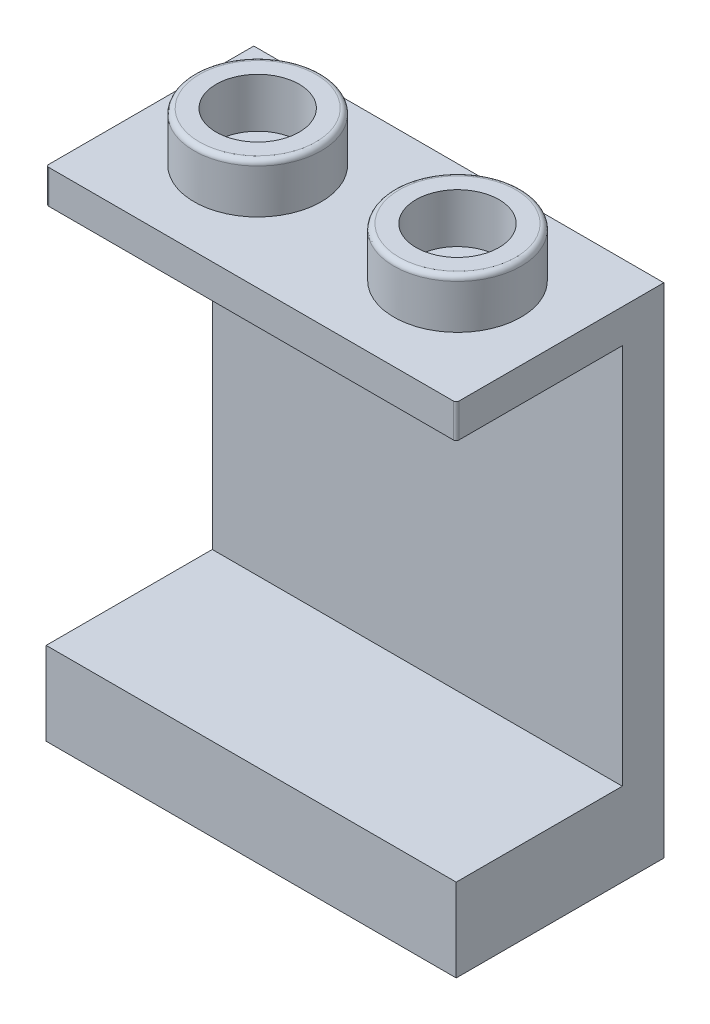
ISO-10303-21;
HEADER;
FILE_DESCRIPTION(('STEP AP214'),'2;1');
FILE_NAME('part.step','',(''),(''),'','','');
FILE_SCHEMA(('AUTOMOTIVE_DESIGN { 1 0 10303 214 1 1 1 1 }'));
ENDSEC;
DATA;
#1=APPLICATION_CONTEXT('core data for automotive mechanical design processes');
#2=APPLICATION_PROTOCOL_DEFINITION('international standard','automotive_design',2000,#1);
#3=PRODUCT_CONTEXT('',#1,'mechanical');
#4=PRODUCT('Part','Part','',(#3));
#5=PRODUCT_RELATED_PRODUCT_CATEGORY('part','',(#4));
#6=PRODUCT_DEFINITION_FORMATION('','',#4);
#7=PRODUCT_DEFINITION_CONTEXT('part definition',#1,'design');
#8=PRODUCT_DEFINITION('design','',#6,#7);
#9=PRODUCT_DEFINITION_SHAPE('','',#8);
#10=(LENGTH_UNIT() NAMED_UNIT(*) SI_UNIT(.MILLI.,.METRE.));
#11=(NAMED_UNIT(*) PLANE_ANGLE_UNIT() SI_UNIT($,.RADIAN.));
#12=(NAMED_UNIT(*) SI_UNIT($,.STERADIAN.) SOLID_ANGLE_UNIT());
#13=UNCERTAINTY_MEASURE_WITH_UNIT(LENGTH_MEASURE(1.E-05),#10,'distance_accuracy_value','');
#14=(GEOMETRIC_REPRESENTATION_CONTEXT(3) GLOBAL_UNCERTAINTY_ASSIGNED_CONTEXT((#13)) GLOBAL_UNIT_ASSIGNED_CONTEXT((#10,
#11,#12)) REPRESENTATION_CONTEXT('',''));
#15=CARTESIAN_POINT('',(0.,0.,0.));
#16=DIRECTION('',(0.,0.,1.));
#17=DIRECTION('',(1.,0.,0.));
#18=AXIS2_PLACEMENT_3D('',#15,#16,#17);
#19=CARTESIAN_POINT('',(14.2,2.1,6.4));
#20=DIRECTION('',(0.,1.,0.));
#21=DIRECTION('',(0.,0.,1.));
#22=AXIS2_PLACEMENT_3D('',#19,#20,#21);
#23=PLANE('',#22);
#24=DIRECTION('',(0.,0.,1.));
#25=VECTOR('',#24,1.);
#26=CARTESIAN_POINT('',(14.2,2.1,6.4));
#27=LINE('',#26,#25);
#28=CARTESIAN_POINT('',(14.2,2.1,1.6));
#29=VERTEX_POINT('',#28);
#30=CARTESIAN_POINT('',(14.2,2.1,6.4));
#31=VERTEX_POINT('',#30);
#32=EDGE_CURVE('E154',#29,#31,#27,.T.);
#33=ORIENTED_EDGE('',*,*,#32,.T.);
#34=DIRECTION('',(-1.,0.,0.));
#35=VECTOR('',#34,1.);
#36=CARTESIAN_POINT('',(14.2,2.1,6.4));
#37=LINE('',#36,#35);
#38=CARTESIAN_POINT('',(1.6,2.1,6.4));
#39=VERTEX_POINT('',#38);
#40=EDGE_CURVE('E160',#31,#39,#37,.T.);
#41=ORIENTED_EDGE('',*,*,#40,.T.);
#42=DIRECTION('',(0.,0.,-1.));
#43=VECTOR('',#42,1.);
#44=CARTESIAN_POINT('',(1.6,2.1,6.4));
#45=LINE('',#44,#43);
#46=CARTESIAN_POINT('',(1.6,2.1,1.6));
#47=VERTEX_POINT('',#46);
#48=EDGE_CURVE('E134',#39,#47,#45,.T.);
#49=ORIENTED_EDGE('',*,*,#48,.T.);
#50=DIRECTION('',(1.,0.,0.));
#51=VECTOR('',#50,1.);
#52=CARTESIAN_POINT('',(14.2,2.1,1.6));
#53=LINE('',#52,#51);
#54=EDGE_CURVE('E163',#47,#29,#53,.T.);
#55=ORIENTED_EDGE('',*,*,#54,.T.);
#56=EDGE_LOOP('',(#33,#41,#49,#55));
#57=FACE_BOUND('',#56,.T.);
#58=CARTESIAN_POINT('',(7.8,2.1,4.));
#59=DIRECTION('',(0.,1.,0.));
#60=DIRECTION('',(0.,0.,1.));
#61=AXIS2_PLACEMENT_3D('',#58,#59,#60);
#62=CIRCLE('',#61,1.55);
#63=CARTESIAN_POINT('',(7.8,2.1,5.55));
#64=VERTEX_POINT('',#63);
#65=EDGE_CURVE('E272',#64,#64,#62,.F.);
#66=ORIENTED_EDGE('',*,*,#65,.F.);
#67=EDGE_LOOP('',(#66));
#68=FACE_BOUND('',#67,.T.);
#69=ADVANCED_FACE('F26',(#57,#68),#23,.F.);
#70=CARTESIAN_POINT('',(0.,19.2,8.));
#71=DIRECTION('',(0.,-1.,0.));
#72=DIRECTION('',(0.,0.,-1.));
#73=AXIS2_PLACEMENT_3D('',#70,#71,#72);
#74=PLANE('',#73);
#75=DIRECTION('',(0.,0.,-1.));
#76=VECTOR('',#75,1.);
#77=CARTESIAN_POINT('',(0.,19.2,8.));
#78=LINE('',#77,#76);
#79=CARTESIAN_POINT('',(0.,19.2,7.9));
#80=VERTEX_POINT('',#79);
#81=CARTESIAN_POINT('',(0.,19.2,0.));
#82=VERTEX_POINT('',#81);
#83=EDGE_CURVE('E228',#80,#82,#78,.T.);
#84=ORIENTED_EDGE('',*,*,#83,.F.);
#85=CARTESIAN_POINT('',(0.0999999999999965,19.2,7.9));
#86=DIRECTION('',(0.,-1.,0.));
#87=DIRECTION('',(0.,0.,-1.));
#88=AXIS2_PLACEMENT_3D('',#85,#86,#87);
#89=CIRCLE('',#88,0.1);
#90=CARTESIAN_POINT('',(0.0999999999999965,19.2,8.));
#91=VERTEX_POINT('',#90);
#92=EDGE_CURVE('E270',#80,#91,#89,.F.);
#93=ORIENTED_EDGE('',*,*,#92,.T.);
#94=DIRECTION('',(-1.,0.,0.));
#95=VECTOR('',#94,1.);
#96=CARTESIAN_POINT('',(0.,19.2,8.));
#97=LINE('',#96,#95);
#98=CARTESIAN_POINT('',(15.7,19.2,8.));
#99=VERTEX_POINT('',#98);
#100=EDGE_CURVE('E225',#99,#91,#97,.T.);
#101=ORIENTED_EDGE('',*,*,#100,.F.);
#102=CARTESIAN_POINT('',(15.7,19.2,7.9));
#103=DIRECTION('',(0.,-1.,0.));
#104=DIRECTION('',(0.,0.,-1.));
#105=AXIS2_PLACEMENT_3D('',#102,#103,#104);
#106=CIRCLE('',#105,0.1);
#107=CARTESIAN_POINT('',(15.8,19.2,7.9));
#108=VERTEX_POINT('',#107);
#109=EDGE_CURVE('E259',#99,#108,#106,.F.);
#110=ORIENTED_EDGE('',*,*,#109,.T.);
#111=DIRECTION('',(0.,0.,-1.));
#112=VECTOR('',#111,1.);
#113=CARTESIAN_POINT('',(15.8,19.2,8.));
#114=LINE('',#113,#112);
#115=CARTESIAN_POINT('',(15.8,19.2,0.));
#116=VERTEX_POINT('',#115);
#117=EDGE_CURVE('E230',#108,#116,#114,.T.);
#118=ORIENTED_EDGE('',*,*,#117,.T.);
#119=DIRECTION('',(-1.,0.,0.));
#120=VECTOR('',#119,1.);
#121=CARTESIAN_POINT('',(0.,19.2,0.));
#122=LINE('',#121,#120);
#123=EDGE_CURVE('E215',#116,#82,#122,.T.);
#124=ORIENTED_EDGE('',*,*,#123,.T.);
#125=EDGE_LOOP('',(#84,#93,#101,#110,#118,#124));
#126=FACE_BOUND('',#125,.T.);
#127=CARTESIAN_POINT('',(4.05,19.2,3.9));
#128=DIRECTION('',(0.,-1.,0.));
#129=DIRECTION('',(0.,0.,-1.));
#130=AXIS2_PLACEMENT_3D('',#127,#128,#129);
#131=CIRCLE('',#130,2.45);
#132=CARTESIAN_POINT('',(4.05,19.2,1.45));
#133=VERTEX_POINT('',#132);
#134=EDGE_CURVE('E238',#133,#133,#131,.F.);
#135=ORIENTED_EDGE('',*,*,#134,.F.);
#136=EDGE_LOOP('',(#135));
#137=FACE_BOUND('',#136,.T.);
#138=CARTESIAN_POINT('',(11.75,19.2,3.9));
#139=DIRECTION('',(0.,-1.,0.));
#140=DIRECTION('',(0.,0.,-1.));
#141=AXIS2_PLACEMENT_3D('',#138,#139,#140);
#142=CIRCLE('',#141,2.45);
#143=CARTESIAN_POINT('',(11.75,19.2,1.45));
#144=VERTEX_POINT('',#143);
#145=EDGE_CURVE('E241',#144,#144,#142,.F.);
#146=ORIENTED_EDGE('',*,*,#145,.F.);
#147=EDGE_LOOP('',(#146));
#148=FACE_BOUND('',#147,.T.);
#149=ADVANCED_FACE('F294',(#126,#137,#148),#74,.F.);
#150=CARTESIAN_POINT('',(0.,19.2,8.));
#151=DIRECTION('',(0.,0.,-1.));
#152=DIRECTION('',(-1.,0.,0.));
#153=AXIS2_PLACEMENT_3D('',#150,#151,#152);
#154=PLANE('',#153);
#155=ORIENTED_EDGE('',*,*,#100,.T.);
#156=DIRECTION('',(0.,-1.,0.));
#157=VECTOR('',#156,1.);
#158=CARTESIAN_POINT('',(0.0999999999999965,19.2,8.));
#159=LINE('',#158,#157);
#160=CARTESIAN_POINT('',(0.0999999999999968,17.9,8.));
#161=VERTEX_POINT('',#160);
#162=EDGE_CURVE('E265',#91,#161,#159,.T.);
#163=ORIENTED_EDGE('',*,*,#162,.T.);
#164=DIRECTION('',(-1.,0.,0.));
#165=VECTOR('',#164,1.);
#166=CARTESIAN_POINT('',(0.,17.9,8.));
#167=LINE('',#166,#165);
#168=CARTESIAN_POINT('',(15.7,17.9,8.));
#169=VERTEX_POINT('',#168);
#170=EDGE_CURVE('E184',#169,#161,#167,.T.);
#171=ORIENTED_EDGE('',*,*,#170,.F.);
#172=DIRECTION('',(0.,1.,0.));
#173=VECTOR('',#172,1.);
#174=CARTESIAN_POINT('',(15.7,19.2,8.));
#175=LINE('',#174,#173);
#176=EDGE_CURVE('E256',#169,#99,#175,.T.);
#177=ORIENTED_EDGE('',*,*,#176,.T.);
#178=EDGE_LOOP('',(#155,#163,#171,#177));
#179=FACE_BOUND('',#178,.T.);
#180=ADVANCED_FACE('F301',(#179),#154,.F.);
#181=CARTESIAN_POINT('',(0.,0.,8.));
#182=DIRECTION('',(1.,0.,0.));
#183=DIRECTION('',(0.,1.,0.));
#184=AXIS2_PLACEMENT_3D('',#181,#182,#183);
#185=PLANE('',#184);
#186=DIRECTION('',(0.,0.,1.));
#187=VECTOR('',#186,1.);
#188=CARTESIAN_POINT('',(0.,17.9,1.6));
#189=LINE('',#188,#187);
#190=CARTESIAN_POINT('',(0.,17.9,1.6));
#191=VERTEX_POINT('',#190);
#192=CARTESIAN_POINT('',(0.,17.9,7.9));
#193=VERTEX_POINT('',#192);
#194=EDGE_CURVE('E198',#191,#193,#189,.T.);
#195=ORIENTED_EDGE('',*,*,#194,.T.);
#196=DIRECTION('',(0.,-1.,0.));
#197=VECTOR('',#196,1.);
#198=CARTESIAN_POINT('',(0.,0.,7.9));
#199=LINE('',#198,#197);
#200=EDGE_CURVE('E41',#193,#80,#199,.F.);
#201=ORIENTED_EDGE('',*,*,#200,.T.);
#202=ORIENTED_EDGE('',*,*,#83,.T.);
#203=DIRECTION('',(0.,-1.,0.));
#204=VECTOR('',#203,1.);
#205=CARTESIAN_POINT('',(0.,0.,0.));
#206=LINE('',#205,#204);
#207=CARTESIAN_POINT('',(0.,0.,0.));
#208=VERTEX_POINT('',#207);
#209=EDGE_CURVE('E200',#82,#208,#206,.T.);
#210=ORIENTED_EDGE('',*,*,#209,.T.);
#211=DIRECTION('',(0.,0.,-1.));
#212=VECTOR('',#211,1.);
#213=CARTESIAN_POINT('',(0.,0.,8.));
#214=LINE('',#213,#212);
#215=CARTESIAN_POINT('',(0.,0.,8.));
#216=VERTEX_POINT('',#215);
#217=EDGE_CURVE('E235',#216,#208,#214,.T.);
#218=ORIENTED_EDGE('',*,*,#217,.F.);
#219=DIRECTION('',(0.,-1.,0.));
#220=VECTOR('',#219,1.);
#221=CARTESIAN_POINT('',(0.,0.,8.));
#222=LINE('',#221,#220);
#223=CARTESIAN_POINT('',(0.,3.2,8.));
#224=VERTEX_POINT('',#223);
#225=EDGE_CURVE('E218',#224,#216,#222,.T.);
#226=ORIENTED_EDGE('',*,*,#225,.F.);
#227=DIRECTION('',(0.,0.,1.));
#228=VECTOR('',#227,1.);
#229=CARTESIAN_POINT('',(0.,3.2,1.6));
#230=LINE('',#229,#228);
#231=CARTESIAN_POINT('',(0.,3.2,1.6));
#232=VERTEX_POINT('',#231);
#233=EDGE_CURVE('E197',#232,#224,#230,.T.);
#234=ORIENTED_EDGE('',*,*,#233,.F.);
#235=DIRECTION('',(0.,-1.,0.));
#236=VECTOR('',#235,1.);
#237=CARTESIAN_POINT('',(0.,17.9,1.6));
#238=LINE('',#237,#236);
#239=EDGE_CURVE('E186',#191,#232,#238,.T.);
#240=ORIENTED_EDGE('',*,*,#239,.F.);
#241=EDGE_LOOP('',(#195,#201,#202,#210,#218,#226,#234,#240));
#242=FACE_BOUND('',#241,.T.);
#243=ADVANCED_FACE('F28',(#242),#185,.F.);
#244=CARTESIAN_POINT('',(0.,0.,8.));
#245=DIRECTION('',(0.,1.,0.));
#246=DIRECTION('',(0.,0.,1.));
#247=AXIS2_PLACEMENT_3D('',#244,#245,#246);
#248=PLANE('',#247);
#249=DIRECTION('',(-1.,0.,0.));
#250=VECTOR('',#249,1.);
#251=CARTESIAN_POINT('',(14.2,0.,6.4));
#252=LINE('',#251,#250);
#253=CARTESIAN_POINT('',(14.2,0.,6.4));
#254=VERTEX_POINT('',#253);
#255=CARTESIAN_POINT('',(1.6,0.,6.4));
#256=VERTEX_POINT('',#255);
#257=EDGE_CURVE('E143',#254,#256,#252,.T.);
#258=ORIENTED_EDGE('',*,*,#257,.F.);
#259=DIRECTION('',(0.,0.,1.));
#260=VECTOR('',#259,1.);
#261=CARTESIAN_POINT('',(14.2,0.,6.4));
#262=LINE('',#261,#260);
#263=CARTESIAN_POINT('',(14.2,0.,1.6));
#264=VERTEX_POINT('',#263);
#265=EDGE_CURVE('E147',#264,#254,#262,.T.);
#266=ORIENTED_EDGE('',*,*,#265,.F.);
#267=DIRECTION('',(1.,0.,0.));
#268=VECTOR('',#267,1.);
#269=CARTESIAN_POINT('',(14.2,0.,1.6));
#270=LINE('',#269,#268);
#271=CARTESIAN_POINT('',(1.6,0.,1.6));
#272=VERTEX_POINT('',#271);
#273=EDGE_CURVE('E152',#272,#264,#270,.T.);
#274=ORIENTED_EDGE('',*,*,#273,.F.);
#275=DIRECTION('',(0.,0.,-1.));
#276=VECTOR('',#275,1.);
#277=CARTESIAN_POINT('',(1.6,0.,6.4));
#278=LINE('',#277,#276);
#279=EDGE_CURVE('E131',#256,#272,#278,.T.);
#280=ORIENTED_EDGE('',*,*,#279,.F.);
#281=EDGE_LOOP('',(#258,#266,#274,#280));
#282=FACE_BOUND('',#281,.T.);
#283=DIRECTION('',(1.,0.,0.));
#284=VECTOR('',#283,1.);
#285=CARTESIAN_POINT('',(0.,0.,0.));
#286=LINE('',#285,#284);
#287=CARTESIAN_POINT('',(15.8,0.,0.));
#288=VERTEX_POINT('',#287);
#289=EDGE_CURVE('E210',#208,#288,#286,.T.);
#290=ORIENTED_EDGE('',*,*,#289,.T.);
#291=DIRECTION('',(0.,0.,-1.));
#292=VECTOR('',#291,1.);
#293=CARTESIAN_POINT('',(15.8,0.,8.));
#294=LINE('',#293,#292);
#295=CARTESIAN_POINT('',(15.8,0.,8.));
#296=VERTEX_POINT('',#295);
#297=EDGE_CURVE('E232',#296,#288,#294,.T.);
#298=ORIENTED_EDGE('',*,*,#297,.F.);
#299=DIRECTION('',(1.,0.,0.));
#300=VECTOR('',#299,1.);
#301=CARTESIAN_POINT('',(0.,0.,8.));
#302=LINE('',#301,#300);
#303=EDGE_CURVE('E220',#216,#296,#302,.T.);
#304=ORIENTED_EDGE('',*,*,#303,.F.);
#305=ORIENTED_EDGE('',*,*,#217,.T.);
#306=EDGE_LOOP('',(#290,#298,#304,#305));
#307=FACE_BOUND('',#306,.T.);
#308=ADVANCED_FACE('F149',(#282,#307),#248,.F.);
#309=CARTESIAN_POINT('',(15.8,0.,8.));
#310=DIRECTION('',(-1.,0.,0.));
#311=DIRECTION('',(0.,-1.,0.));
#312=AXIS2_PLACEMENT_3D('',#309,#310,#311);
#313=PLANE('',#312);
#314=ORIENTED_EDGE('',*,*,#117,.F.);
#315=DIRECTION('',(0.,1.,0.));
#316=VECTOR('',#315,1.);
#317=CARTESIAN_POINT('',(15.8,0.,7.9));
#318=LINE('',#317,#316);
#319=CARTESIAN_POINT('',(15.8,17.9,7.9));
#320=VERTEX_POINT('',#319);
#321=EDGE_CURVE('E261',#108,#320,#318,.F.);
#322=ORIENTED_EDGE('',*,*,#321,.T.);
#323=DIRECTION('',(0.,0.,1.));
#324=VECTOR('',#323,1.);
#325=CARTESIAN_POINT('',(15.8,17.9,1.6));
#326=LINE('',#325,#324);
#327=CARTESIAN_POINT('',(15.8,17.9,1.6));
#328=VERTEX_POINT('',#327);
#329=EDGE_CURVE('E201',#328,#320,#326,.T.);
#330=ORIENTED_EDGE('',*,*,#329,.F.);
#331=DIRECTION('',(0.,1.,0.));
#332=VECTOR('',#331,1.);
#333=CARTESIAN_POINT('',(15.8,17.9,1.6));
#334=LINE('',#333,#332);
#335=CARTESIAN_POINT('',(15.8,3.2,1.6));
#336=VERTEX_POINT('',#335);
#337=EDGE_CURVE('E192',#336,#328,#334,.T.);
#338=ORIENTED_EDGE('',*,*,#337,.F.);
#339=DIRECTION('',(0.,0.,1.));
#340=VECTOR('',#339,1.);
#341=CARTESIAN_POINT('',(15.8,3.2,1.6));
#342=LINE('',#341,#340);
#343=CARTESIAN_POINT('',(15.8,3.2,8.));
#344=VERTEX_POINT('',#343);
#345=EDGE_CURVE('E204',#336,#344,#342,.T.);
#346=ORIENTED_EDGE('',*,*,#345,.T.);
#347=DIRECTION('',(0.,1.,0.));
#348=VECTOR('',#347,1.);
#349=CARTESIAN_POINT('',(15.8,0.,8.));
#350=LINE('',#349,#348);
#351=EDGE_CURVE('E222',#296,#344,#350,.T.);
#352=ORIENTED_EDGE('',*,*,#351,.F.);
#353=ORIENTED_EDGE('',*,*,#297,.T.);
#354=DIRECTION('',(0.,1.,0.));
#355=VECTOR('',#354,1.);
#356=CARTESIAN_POINT('',(15.8,0.,0.));
#357=LINE('',#356,#355);
#358=EDGE_CURVE('E212',#288,#116,#357,.T.);
#359=ORIENTED_EDGE('',*,*,#358,.T.);
#360=EDGE_LOOP('',(#314,#322,#330,#338,#346,#352,#353,#359));
#361=FACE_BOUND('',#360,.T.);
#362=ADVANCED_FACE('F372',(#361),#313,.F.);
#363=ORIENTED_EDGE('',*,*,#351,.T.);
#364=DIRECTION('',(1.,0.,0.));
#365=VECTOR('',#364,1.);
#366=CARTESIAN_POINT('',(0.,3.2,8.));
#367=LINE('',#366,#365);
#368=EDGE_CURVE('E182',#224,#344,#367,.T.);
#369=ORIENTED_EDGE('',*,*,#368,.F.);
#370=ORIENTED_EDGE('',*,*,#225,.T.);
#371=ORIENTED_EDGE('',*,*,#303,.T.);
#372=EDGE_LOOP('',(#363,#369,#370,#371));
#373=FACE_BOUND('',#372,.T.);
#374=ADVANCED_FACE('F369',(#373),#154,.F.);
#375=CARTESIAN_POINT('',(0.,19.2,0.));
#376=DIRECTION('',(0.,0.,-1.));
#377=DIRECTION('',(-1.,0.,0.));
#378=AXIS2_PLACEMENT_3D('',#375,#376,#377);
#379=PLANE('',#378);
#380=ORIENTED_EDGE('',*,*,#209,.F.);
#381=ORIENTED_EDGE('',*,*,#123,.F.);
#382=ORIENTED_EDGE('',*,*,#358,.F.);
#383=ORIENTED_EDGE('',*,*,#289,.F.);
#384=EDGE_LOOP('',(#380,#381,#382,#383));
#385=FACE_BOUND('',#384,.T.);
#386=ADVANCED_FACE('F363',(#385),#379,.T.);
#387=CARTESIAN_POINT('',(0.,17.9,1.6));
#388=DIRECTION('',(0.,1.,0.));
#389=DIRECTION('',(0.,0.,1.));
#390=AXIS2_PLACEMENT_3D('',#387,#388,#389);
#391=PLANE('',#390);
#392=ORIENTED_EDGE('',*,*,#170,.T.);
#393=CARTESIAN_POINT('',(0.0999999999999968,17.9,7.9));
#394=DIRECTION('',(0.,1.,0.));
#395=DIRECTION('',(0.,0.,1.));
#396=AXIS2_PLACEMENT_3D('',#393,#394,#395);
#397=CIRCLE('',#396,0.1);
#398=EDGE_CURVE('E49',#161,#193,#397,.F.);
#399=ORIENTED_EDGE('',*,*,#398,.T.);
#400=ORIENTED_EDGE('',*,*,#194,.F.);
#401=DIRECTION('',(-1.,0.,0.));
#402=VECTOR('',#401,1.);
#403=CARTESIAN_POINT('',(0.,17.9,1.6));
#404=LINE('',#403,#402);
#405=EDGE_CURVE('E194',#328,#191,#404,.T.);
#406=ORIENTED_EDGE('',*,*,#405,.F.);
#407=ORIENTED_EDGE('',*,*,#329,.T.);
#408=CARTESIAN_POINT('',(15.7,17.9,7.9));
#409=DIRECTION('',(0.,1.,0.));
#410=DIRECTION('',(0.,0.,1.));
#411=AXIS2_PLACEMENT_3D('',#408,#409,#410);
#412=CIRCLE('',#411,0.1);
#413=EDGE_CURVE('E263',#320,#169,#412,.F.);
#414=ORIENTED_EDGE('',*,*,#413,.T.);
#415=EDGE_LOOP('',(#392,#399,#400,#406,#407,#414));
#416=FACE_BOUND('',#415,.T.);
#417=ADVANCED_FACE('F360',(#416),#391,.F.);
#418=CARTESIAN_POINT('',(0.,3.2,1.6));
#419=DIRECTION('',(0.,-1.,0.));
#420=DIRECTION('',(1.,0.,0.));
#421=AXIS2_PLACEMENT_3D('',#418,#419,#420);
#422=PLANE('',#421);
#423=ORIENTED_EDGE('',*,*,#368,.T.);
#424=ORIENTED_EDGE('',*,*,#345,.F.);
#425=DIRECTION('',(1.,0.,0.));
#426=VECTOR('',#425,1.);
#427=CARTESIAN_POINT('',(0.,3.2,1.6));
#428=LINE('',#427,#426);
#429=EDGE_CURVE('E189',#232,#336,#428,.T.);
#430=ORIENTED_EDGE('',*,*,#429,.F.);
#431=ORIENTED_EDGE('',*,*,#233,.T.);
#432=EDGE_LOOP('',(#423,#424,#430,#431));
#433=FACE_BOUND('',#432,.T.);
#434=ADVANCED_FACE('F358',(#433),#422,.F.);
#435=CARTESIAN_POINT('',(0.,3.2,1.6));
#436=DIRECTION('',(0.,0.,1.));
#437=DIRECTION('',(1.,0.,0.));
#438=AXIS2_PLACEMENT_3D('',#435,#436,#437);
#439=PLANE('',#438);
#440=ORIENTED_EDGE('',*,*,#239,.T.);
#441=ORIENTED_EDGE('',*,*,#429,.T.);
#442=ORIENTED_EDGE('',*,*,#337,.T.);
#443=ORIENTED_EDGE('',*,*,#405,.T.);
#444=EDGE_LOOP('',(#440,#441,#442,#443));
#445=FACE_BOUND('',#444,.T.);
#446=ADVANCED_FACE('F351',(#445),#439,.T.);
#447=CARTESIAN_POINT('',(4.05,21.1,3.9));
#448=DIRECTION('',(0.,1.,0.));
#449=DIRECTION('',(0.,0.,1.));
#450=AXIS2_PLACEMENT_3D('',#447,#448,#449);
#451=PLANE('',#450);
#452=CARTESIAN_POINT('',(4.05,21.1,3.9));
#453=DIRECTION('',(0.,1.,0.));
#454=DIRECTION('',(0.,0.,1.));
#455=AXIS2_PLACEMENT_3D('',#452,#453,#454);
#456=CIRCLE('',#455,2.25);
#457=CARTESIAN_POINT('',(4.05,21.1,6.15));
#458=VERTEX_POINT('',#457);
#459=EDGE_CURVE('E250',#458,#458,#456,.T.);
#460=ORIENTED_EDGE('',*,*,#459,.T.);
#461=EDGE_LOOP('',(#460));
#462=FACE_BOUND('',#461,.T.);
#463=CARTESIAN_POINT('',(4.05,21.1,3.9));
#464=DIRECTION('',(0.,1.,0.));
#465=DIRECTION('',(0.,0.,1.));
#466=AXIS2_PLACEMENT_3D('',#463,#464,#465);
#467=CIRCLE('',#466,1.6);
#468=CARTESIAN_POINT('',(4.05,21.1,2.3));
#469=VERTEX_POINT('',#468);
#470=EDGE_CURVE('E179',#469,#469,#467,.T.);
#471=ORIENTED_EDGE('',*,*,#470,.F.);
#472=EDGE_LOOP('',(#471));
#473=FACE_BOUND('',#472,.T.);
#474=ADVANCED_FACE('F348',(#462,#473),#451,.T.);
#475=CARTESIAN_POINT('',(4.05,21.1,3.9));
#476=DIRECTION('',(0.,-1.,0.));
#477=DIRECTION('',(0.,0.,-1.));
#478=AXIS2_PLACEMENT_3D('',#475,#476,#477);
#479=CYLINDRICAL_SURFACE('',#478,2.45);
#480=CARTESIAN_POINT('',(4.05,20.9,3.9));
#481=DIRECTION('',(0.,1.,0.));
#482=DIRECTION('',(0.,0.,1.));
#483=AXIS2_PLACEMENT_3D('',#480,#481,#482);
#484=CIRCLE('',#483,2.45);
#485=CARTESIAN_POINT('',(4.05,20.9,1.45));
#486=VERTEX_POINT('',#485);
#487=EDGE_CURVE('E253',#486,#486,#484,.F.);
#488=CARTESIAN_POINT('',(4.05,20.9,1.45));
#489=CARTESIAN_POINT('',(4.05,20.8822916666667,1.45));
#490=CARTESIAN_POINT('',(4.05,20.8645833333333,1.45));
#491=CARTESIAN_POINT('',(4.05,20.8291666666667,1.45));
#492=CARTESIAN_POINT('',(4.05,20.8114583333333,1.45));
#493=CARTESIAN_POINT('',(4.05,20.7760416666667,1.45));
#494=CARTESIAN_POINT('',(4.05,20.7583333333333,1.45));
#495=CARTESIAN_POINT('',(4.05,20.7229166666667,1.45));
#496=CARTESIAN_POINT('',(4.05,20.7052083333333,1.45));
#497=CARTESIAN_POINT('',(4.05,20.6697916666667,1.45));
#498=CARTESIAN_POINT('',(4.05,20.6520833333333,1.45));
#499=CARTESIAN_POINT('',(4.05,20.6166666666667,1.45));
#500=CARTESIAN_POINT('',(4.05,20.5989583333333,1.45));
#501=CARTESIAN_POINT('',(4.05,20.5635416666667,1.45));
#502=CARTESIAN_POINT('',(4.05,20.5458333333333,1.45));
#503=CARTESIAN_POINT('',(4.05,20.5104166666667,1.45));
#504=CARTESIAN_POINT('',(4.05,20.4927083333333,1.45));
#505=CARTESIAN_POINT('',(4.05,20.4572916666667,1.45));
#506=CARTESIAN_POINT('',(4.05,20.4395833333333,1.45));
#507=CARTESIAN_POINT('',(4.05,20.4041666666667,1.45));
#508=CARTESIAN_POINT('',(4.05,20.3864583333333,1.45));
#509=CARTESIAN_POINT('',(4.05,20.3510416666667,1.45));
#510=CARTESIAN_POINT('',(4.05,20.3333333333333,1.45));
#511=CARTESIAN_POINT('',(4.05,20.2979166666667,1.45));
#512=CARTESIAN_POINT('',(4.05,20.2802083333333,1.45));
#513=CARTESIAN_POINT('',(4.05,20.2447916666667,1.45));
#514=CARTESIAN_POINT('',(4.05,20.2270833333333,1.45));
#515=CARTESIAN_POINT('',(4.05,20.1916666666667,1.45));
#516=CARTESIAN_POINT('',(4.05,20.1739583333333,1.45));
#517=CARTESIAN_POINT('',(4.05,20.1385416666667,1.45));
#518=CARTESIAN_POINT('',(4.05,20.1208333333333,1.45));
#519=CARTESIAN_POINT('',(4.05,20.0854166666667,1.45));
#520=CARTESIAN_POINT('',(4.05,20.0677083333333,1.45));
#521=CARTESIAN_POINT('',(4.05,20.0322916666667,1.45));
#522=CARTESIAN_POINT('',(4.05,20.0145833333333,1.45));
#523=CARTESIAN_POINT('',(4.05,19.9791666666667,1.45));
#524=CARTESIAN_POINT('',(4.05,19.9614583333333,1.45));
#525=CARTESIAN_POINT('',(4.05,19.9260416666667,1.45));
#526=CARTESIAN_POINT('',(4.05,19.9083333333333,1.45));
#527=CARTESIAN_POINT('',(4.05,19.8729166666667,1.45));
#528=CARTESIAN_POINT('',(4.05,19.8552083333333,1.45));
#529=CARTESIAN_POINT('',(4.05,19.8197916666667,1.45));
#530=CARTESIAN_POINT('',(4.05,19.8020833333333,1.45));
#531=CARTESIAN_POINT('',(4.05,19.7666666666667,1.45));
#532=CARTESIAN_POINT('',(4.05,19.7489583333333,1.45));
#533=CARTESIAN_POINT('',(4.05,19.7135416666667,1.45));
#534=CARTESIAN_POINT('',(4.05,19.6958333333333,1.45));
#535=CARTESIAN_POINT('',(4.05,19.6604166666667,1.45));
#536=CARTESIAN_POINT('',(4.05,19.6427083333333,1.45));
#537=CARTESIAN_POINT('',(4.05,19.6072916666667,1.45));
#538=CARTESIAN_POINT('',(4.05,19.5895833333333,1.45));
#539=CARTESIAN_POINT('',(4.05,19.5541666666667,1.45));
#540=CARTESIAN_POINT('',(4.05,19.5364583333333,1.45));
#541=CARTESIAN_POINT('',(4.05,19.5010416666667,1.45));
#542=CARTESIAN_POINT('',(4.05,19.4833333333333,1.45));
#543=CARTESIAN_POINT('',(4.05,19.4479166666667,1.45));
#544=CARTESIAN_POINT('',(4.05,19.4302083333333,1.45));
#545=CARTESIAN_POINT('',(4.05,19.3947916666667,1.45));
#546=CARTESIAN_POINT('',(4.05,19.3770833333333,1.45));
#547=CARTESIAN_POINT('',(4.05,19.3416666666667,1.45));
#548=CARTESIAN_POINT('',(4.05,19.3239583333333,1.45));
#549=CARTESIAN_POINT('',(4.05,19.2885416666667,1.45));
#550=CARTESIAN_POINT('',(4.05,19.2708333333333,1.45));
#551=CARTESIAN_POINT('',(4.05,19.2354166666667,1.45));
#552=CARTESIAN_POINT('',(4.05,19.2177083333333,1.45));
#553=CARTESIAN_POINT('',(4.05,19.2,1.45));
#554=B_SPLINE_CURVE_WITH_KNOTS('',3,(#488,#489,#490,#491,#492,#493,#494,#495,#496,#497,#498,
#499,#500,#501,#502,#503,#504,#505,#506,#507,#508,#509,#510,#511,#512,#513,#514,#515,#516,#517,
#518,#519,#520,#521,#522,#523,#524,#525,#526,#527,#528,#529,#530,#531,#532,#533,#534,#535,#536,
#537,#538,#539,#540,#541,#542,#543,#544,#545,#546,#547,#548,#549,#550,#551,#552,#553),
.UNSPECIFIED.,.F.,.F.,(4,2,2,2,2,2,2,2,2,2,2,2,2,2,2,2,2,2,2,2,2,2,2,2,2,2,2,2,2,2,2,2,4),(0.,
0.0531250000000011,0.106250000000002,0.159375,0.212500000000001,0.265625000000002,0.31875,
0.371875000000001,0.425000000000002,0.478124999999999,0.53125,0.584375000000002,
0.637499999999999,0.690625,0.743750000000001,0.796874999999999,0.85,0.903125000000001,
0.956249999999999,1.009375,1.0625,1.115625,1.16875,1.221875,1.275,1.328125,1.38125,1.434375,
1.4875,1.540625,1.59375,1.646875,1.7),.UNSPECIFIED.);
#555=EDGE_CURVE('BSEAM346',#486,#133,#554,.T.);
#556=ORIENTED_EDGE('',*,*,#487,.T.);
#557=ORIENTED_EDGE('',*,*,#134,.T.);
#558=ORIENTED_EDGE('',*,*,#555,.T.);
#559=ORIENTED_EDGE('',*,*,#555,.F.);
#560=EDGE_LOOP('',(#556,#558,#557,#559));
#561=FACE_BOUND('',#560,.T.);
#562=ADVANCED_FACE('F346',(#561),#479,.T.);
#563=CARTESIAN_POINT('',(4.05,21.1,3.9));
#564=DIRECTION('',(0.,-1.,0.));
#565=DIRECTION('',(0.,0.,-1.));
#566=AXIS2_PLACEMENT_3D('',#563,#564,#565);
#567=CYLINDRICAL_SURFACE('',#566,1.6);
#568=CARTESIAN_POINT('',(4.05,19.2,3.9));
#569=DIRECTION('',(0.,1.,0.));
#570=DIRECTION('',(0.,0.,1.));
#571=AXIS2_PLACEMENT_3D('',#568,#569,#570);
#572=CIRCLE('',#571,1.6);
#573=CARTESIAN_POINT('',(4.05,19.2,2.3));
#574=VERTEX_POINT('',#573);
#575=EDGE_CURVE('E176',#574,#574,#572,.T.);
#576=CARTESIAN_POINT('',(4.05,21.1,2.3));
#577=CARTESIAN_POINT('',(4.05,21.0802083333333,2.3));
#578=CARTESIAN_POINT('',(4.05,21.0604166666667,2.3));
#579=CARTESIAN_POINT('',(4.05,21.0208333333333,2.3));
#580=CARTESIAN_POINT('',(4.05,21.0010416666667,2.3));
#581=CARTESIAN_POINT('',(4.05,20.9614583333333,2.3));
#582=CARTESIAN_POINT('',(4.05,20.9416666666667,2.3));
#583=CARTESIAN_POINT('',(4.05,20.9020833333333,2.3));
#584=CARTESIAN_POINT('',(4.05,20.8822916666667,2.3));
#585=CARTESIAN_POINT('',(4.05,20.8427083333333,2.3));
#586=CARTESIAN_POINT('',(4.05,20.8229166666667,2.3));
#587=CARTESIAN_POINT('',(4.05,20.7833333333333,2.3));
#588=CARTESIAN_POINT('',(4.05,20.7635416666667,2.3));
#589=CARTESIAN_POINT('',(4.05,20.7239583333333,2.3));
#590=CARTESIAN_POINT('',(4.05,20.7041666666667,2.3));
#591=CARTESIAN_POINT('',(4.05,20.6645833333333,2.3));
#592=CARTESIAN_POINT('',(4.05,20.6447916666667,2.3));
#593=CARTESIAN_POINT('',(4.05,20.6052083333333,2.3));
#594=CARTESIAN_POINT('',(4.05,20.5854166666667,2.3));
#595=CARTESIAN_POINT('',(4.05,20.5458333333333,2.3));
#596=CARTESIAN_POINT('',(4.05,20.5260416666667,2.3));
#597=CARTESIAN_POINT('',(4.05,20.4864583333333,2.3));
#598=CARTESIAN_POINT('',(4.05,20.4666666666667,2.3));
#599=CARTESIAN_POINT('',(4.05,20.4270833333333,2.3));
#600=CARTESIAN_POINT('',(4.05,20.4072916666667,2.3));
#601=CARTESIAN_POINT('',(4.05,20.3677083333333,2.3));
#602=CARTESIAN_POINT('',(4.05,20.3479166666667,2.3));
#603=CARTESIAN_POINT('',(4.05,20.3083333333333,2.3));
#604=CARTESIAN_POINT('',(4.05,20.2885416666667,2.3));
#605=CARTESIAN_POINT('',(4.05,20.2489583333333,2.3));
#606=CARTESIAN_POINT('',(4.05,20.2291666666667,2.3));
#607=CARTESIAN_POINT('',(4.05,20.1895833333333,2.3));
#608=CARTESIAN_POINT('',(4.05,20.1697916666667,2.3));
#609=CARTESIAN_POINT('',(4.05,20.1302083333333,2.3));
#610=CARTESIAN_POINT('',(4.05,20.1104166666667,2.3));
#611=CARTESIAN_POINT('',(4.05,20.0708333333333,2.3));
#612=CARTESIAN_POINT('',(4.05,20.0510416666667,2.3));
#613=CARTESIAN_POINT('',(4.05,20.0114583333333,2.3));
#614=CARTESIAN_POINT('',(4.05,19.9916666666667,2.3));
#615=CARTESIAN_POINT('',(4.05,19.9520833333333,2.3));
#616=CARTESIAN_POINT('',(4.05,19.9322916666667,2.3));
#617=CARTESIAN_POINT('',(4.05,19.8927083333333,2.3));
#618=CARTESIAN_POINT('',(4.05,19.8729166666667,2.3));
#619=CARTESIAN_POINT('',(4.05,19.8333333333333,2.3));
#620=CARTESIAN_POINT('',(4.05,19.8135416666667,2.3));
#621=CARTESIAN_POINT('',(4.05,19.7739583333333,2.3));
#622=CARTESIAN_POINT('',(4.05,19.7541666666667,2.3));
#623=CARTESIAN_POINT('',(4.05,19.7145833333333,2.3));
#624=CARTESIAN_POINT('',(4.05,19.6947916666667,2.3));
#625=CARTESIAN_POINT('',(4.05,19.6552083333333,2.3));
#626=CARTESIAN_POINT('',(4.05,19.6354166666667,2.3));
#627=CARTESIAN_POINT('',(4.05,19.5958333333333,2.3));
#628=CARTESIAN_POINT('',(4.05,19.5760416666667,2.3));
#629=CARTESIAN_POINT('',(4.05,19.5364583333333,2.3));
#630=CARTESIAN_POINT('',(4.05,19.5166666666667,2.3));
#631=CARTESIAN_POINT('',(4.05,19.4770833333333,2.3));
#632=CARTESIAN_POINT('',(4.05,19.4572916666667,2.3));
#633=CARTESIAN_POINT('',(4.05,19.4177083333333,2.3));
#634=CARTESIAN_POINT('',(4.05,19.3979166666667,2.3));
#635=CARTESIAN_POINT('',(4.05,19.3583333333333,2.3));
#636=CARTESIAN_POINT('',(4.05,19.3385416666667,2.3));
#637=CARTESIAN_POINT('',(4.05,19.2989583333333,2.3));
#638=CARTESIAN_POINT('',(4.05,19.2791666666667,2.3));
#639=CARTESIAN_POINT('',(4.05,19.2395833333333,2.3));
#640=CARTESIAN_POINT('',(4.05,19.2197916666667,2.3));
#641=CARTESIAN_POINT('',(4.05,19.2,2.3));
#642=B_SPLINE_CURVE_WITH_KNOTS('',3,(#576,#577,#578,#579,#580,#581,#582,#583,#584,#585,#586,
#587,#588,#589,#590,#591,#592,#593,#594,#595,#596,#597,#598,#599,#600,#601,#602,#603,#604,#605,
#606,#607,#608,#609,#610,#611,#612,#613,#614,#615,#616,#617,#618,#619,#620,#621,#622,#623,#624,
#625,#626,#627,#628,#629,#630,#631,#632,#633,#634,#635,#636,#637,#638,#639,#640,#641),
.UNSPECIFIED.,.F.,.F.,(4,2,2,2,2,2,2,2,2,2,2,2,2,2,2,2,2,2,2,2,2,2,2,2,2,2,2,2,2,2,2,2,4),(0.,
0.0593749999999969,0.118749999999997,0.178124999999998,0.237499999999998,0.296874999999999,
0.356249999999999,0.415624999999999,0.474999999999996,0.534374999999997,0.593749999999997,
0.653124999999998,0.712499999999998,0.771874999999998,0.831249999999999,0.890624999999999,
0.949999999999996,1.009375,1.06875,1.128125,1.1875,1.246875,1.30625,1.365625,1.425,1.484375,
1.54375,1.603125,1.6625,1.721875,1.78125,1.840625,1.9),.UNSPECIFIED.);
#643=EDGE_CURVE('BSEAM343',#469,#574,#642,.T.);
#644=ORIENTED_EDGE('',*,*,#470,.T.);
#645=ORIENTED_EDGE('',*,*,#575,.F.);
#646=ORIENTED_EDGE('',*,*,#643,.T.);
#647=ORIENTED_EDGE('',*,*,#643,.F.);
#648=EDGE_LOOP('',(#644,#646,#645,#647));
#649=FACE_BOUND('',#648,.T.);
#650=ADVANCED_FACE('F343',(#649),#567,.F.);
#651=ORIENTED_EDGE('',*,*,#575,.T.);
#652=EDGE_LOOP('',(#651));
#653=FACE_BOUND('',#652,.T.);
#654=ADVANCED_FACE('F305',(#653),#74,.F.);
#655=CARTESIAN_POINT('',(11.75,21.1,3.9));
#656=DIRECTION('',(0.,1.,0.));
#657=DIRECTION('',(0.,0.,1.));
#658=AXIS2_PLACEMENT_3D('',#655,#656,#657);
#659=PLANE('',#658);
#660=CARTESIAN_POINT('',(11.75,21.1,3.9));
#661=DIRECTION('',(0.,1.,0.));
#662=DIRECTION('',(0.,0.,1.));
#663=AXIS2_PLACEMENT_3D('',#660,#661,#662);
#664=CIRCLE('',#663,2.25);
#665=CARTESIAN_POINT('',(11.75,21.1,6.15));
#666=VERTEX_POINT('',#665);
#667=EDGE_CURVE('E244',#666,#666,#664,.T.);
#668=ORIENTED_EDGE('',*,*,#667,.T.);
#669=EDGE_LOOP('',(#668));
#670=FACE_BOUND('',#669,.T.);
#671=CARTESIAN_POINT('',(11.75,21.1,3.9));
#672=DIRECTION('',(0.,1.,0.));
#673=DIRECTION('',(0.,0.,1.));
#674=AXIS2_PLACEMENT_3D('',#671,#672,#673);
#675=CIRCLE('',#674,1.6);
#676=CARTESIAN_POINT('',(11.75,21.1,2.3));
#677=VERTEX_POINT('',#676);
#678=EDGE_CURVE('E173',#677,#677,#675,.T.);
#679=ORIENTED_EDGE('',*,*,#678,.F.);
#680=EDGE_LOOP('',(#679));
#681=FACE_BOUND('',#680,.T.);
#682=ADVANCED_FACE('F336',(#670,#681),#659,.T.);
#683=CARTESIAN_POINT('',(11.75,21.1,3.9));
#684=DIRECTION('',(0.,-1.,0.));
#685=DIRECTION('',(0.,0.,-1.));
#686=AXIS2_PLACEMENT_3D('',#683,#684,#685);
#687=CYLINDRICAL_SURFACE('',#686,2.45);
#688=CARTESIAN_POINT('',(11.75,20.9,3.9));
#689=DIRECTION('',(0.,1.,0.));
#690=DIRECTION('',(0.,0.,1.));
#691=AXIS2_PLACEMENT_3D('',#688,#689,#690);
#692=CIRCLE('',#691,2.45);
#693=CARTESIAN_POINT('',(11.75,20.9,1.45));
#694=VERTEX_POINT('',#693);
#695=EDGE_CURVE('E247',#694,#694,#692,.F.);
#696=CARTESIAN_POINT('',(11.75,20.9,1.45));
#697=CARTESIAN_POINT('',(11.75,20.8822916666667,1.45));
#698=CARTESIAN_POINT('',(11.75,20.8645833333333,1.45));
#699=CARTESIAN_POINT('',(11.75,20.8291666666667,1.45));
#700=CARTESIAN_POINT('',(11.75,20.8114583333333,1.45));
#701=CARTESIAN_POINT('',(11.75,20.7760416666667,1.45));
#702=CARTESIAN_POINT('',(11.75,20.7583333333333,1.45));
#703=CARTESIAN_POINT('',(11.75,20.7229166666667,1.45));
#704=CARTESIAN_POINT('',(11.75,20.7052083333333,1.45));
#705=CARTESIAN_POINT('',(11.75,20.6697916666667,1.45));
#706=CARTESIAN_POINT('',(11.75,20.6520833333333,1.45));
#707=CARTESIAN_POINT('',(11.75,20.6166666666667,1.45));
#708=CARTESIAN_POINT('',(11.75,20.5989583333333,1.45));
#709=CARTESIAN_POINT('',(11.75,20.5635416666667,1.45));
#710=CARTESIAN_POINT('',(11.75,20.5458333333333,1.45));
#711=CARTESIAN_POINT('',(11.75,20.5104166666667,1.45));
#712=CARTESIAN_POINT('',(11.75,20.4927083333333,1.45));
#713=CARTESIAN_POINT('',(11.75,20.4572916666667,1.45));
#714=CARTESIAN_POINT('',(11.75,20.4395833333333,1.45));
#715=CARTESIAN_POINT('',(11.75,20.4041666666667,1.45));
#716=CARTESIAN_POINT('',(11.75,20.3864583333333,1.45));
#717=CARTESIAN_POINT('',(11.75,20.3510416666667,1.45));
#718=CARTESIAN_POINT('',(11.75,20.3333333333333,1.45));
#719=CARTESIAN_POINT('',(11.75,20.2979166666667,1.45));
#720=CARTESIAN_POINT('',(11.75,20.2802083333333,1.45));
#721=CARTESIAN_POINT('',(11.75,20.2447916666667,1.45));
#722=CARTESIAN_POINT('',(11.75,20.2270833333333,1.45));
#723=CARTESIAN_POINT('',(11.75,20.1916666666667,1.45));
#724=CARTESIAN_POINT('',(11.75,20.1739583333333,1.45));
#725=CARTESIAN_POINT('',(11.75,20.1385416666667,1.45));
#726=CARTESIAN_POINT('',(11.75,20.1208333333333,1.45));
#727=CARTESIAN_POINT('',(11.75,20.0854166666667,1.45));
#728=CARTESIAN_POINT('',(11.75,20.0677083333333,1.45));
#729=CARTESIAN_POINT('',(11.75,20.0322916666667,1.45));
#730=CARTESIAN_POINT('',(11.75,20.0145833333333,1.45));
#731=CARTESIAN_POINT('',(11.75,19.9791666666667,1.45));
#732=CARTESIAN_POINT('',(11.75,19.9614583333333,1.45));
#733=CARTESIAN_POINT('',(11.75,19.9260416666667,1.45));
#734=CARTESIAN_POINT('',(11.75,19.9083333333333,1.45));
#735=CARTESIAN_POINT('',(11.75,19.8729166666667,1.45));
#736=CARTESIAN_POINT('',(11.75,19.8552083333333,1.45));
#737=CARTESIAN_POINT('',(11.75,19.8197916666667,1.45));
#738=CARTESIAN_POINT('',(11.75,19.8020833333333,1.45));
#739=CARTESIAN_POINT('',(11.75,19.7666666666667,1.45));
#740=CARTESIAN_POINT('',(11.75,19.7489583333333,1.45));
#741=CARTESIAN_POINT('',(11.75,19.7135416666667,1.45));
#742=CARTESIAN_POINT('',(11.75,19.6958333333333,1.45));
#743=CARTESIAN_POINT('',(11.75,19.6604166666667,1.45));
#744=CARTESIAN_POINT('',(11.75,19.6427083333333,1.45));
#745=CARTESIAN_POINT('',(11.75,19.6072916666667,1.45));
#746=CARTESIAN_POINT('',(11.75,19.5895833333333,1.45));
#747=CARTESIAN_POINT('',(11.75,19.5541666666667,1.45));
#748=CARTESIAN_POINT('',(11.75,19.5364583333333,1.45));
#749=CARTESIAN_POINT('',(11.75,19.5010416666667,1.45));
#750=CARTESIAN_POINT('',(11.75,19.4833333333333,1.45));
#751=CARTESIAN_POINT('',(11.75,19.4479166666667,1.45));
#752=CARTESIAN_POINT('',(11.75,19.4302083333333,1.45));
#753=CARTESIAN_POINT('',(11.75,19.3947916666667,1.45));
#754=CARTESIAN_POINT('',(11.75,19.3770833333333,1.45));
#755=CARTESIAN_POINT('',(11.75,19.3416666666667,1.45));
#756=CARTESIAN_POINT('',(11.75,19.3239583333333,1.45));
#757=CARTESIAN_POINT('',(11.75,19.2885416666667,1.45));
#758=CARTESIAN_POINT('',(11.75,19.2708333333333,1.45));
#759=CARTESIAN_POINT('',(11.75,19.2354166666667,1.45));
#760=CARTESIAN_POINT('',(11.75,19.2177083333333,1.45));
#761=CARTESIAN_POINT('',(11.75,19.2,1.45));
#762=B_SPLINE_CURVE_WITH_KNOTS('',3,(#696,#697,#698,#699,#700,#701,#702,#703,#704,#705,#706,
#707,#708,#709,#710,#711,#712,#713,#714,#715,#716,#717,#718,#719,#720,#721,#722,#723,#724,#725,
#726,#727,#728,#729,#730,#731,#732,#733,#734,#735,#736,#737,#738,#739,#740,#741,#742,#743,#744,
#745,#746,#747,#748,#749,#750,#751,#752,#753,#754,#755,#756,#757,#758,#759,#760,#761),
.UNSPECIFIED.,.F.,.F.,(4,2,2,2,2,2,2,2,2,2,2,2,2,2,2,2,2,2,2,2,2,2,2,2,2,2,2,2,2,2,2,2,4),(0.,
0.0531250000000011,0.106250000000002,0.159375,0.212500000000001,0.265625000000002,0.31875,
0.371875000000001,0.425000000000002,0.478124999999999,0.53125,0.584375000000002,
0.637499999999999,0.690625,0.743750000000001,0.796874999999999,0.85,0.903125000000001,
0.956249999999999,1.009375,1.0625,1.115625,1.16875,1.221875,1.275,1.328125,1.38125,1.434375,
1.4875,1.540625,1.59375,1.646875,1.7),.UNSPECIFIED.);
#763=EDGE_CURVE('BSEAM334',#694,#144,#762,.T.);
#764=ORIENTED_EDGE('',*,*,#695,.T.);
#765=ORIENTED_EDGE('',*,*,#145,.T.);
#766=ORIENTED_EDGE('',*,*,#763,.T.);
#767=ORIENTED_EDGE('',*,*,#763,.F.);
#768=EDGE_LOOP('',(#764,#766,#765,#767));
#769=FACE_BOUND('',#768,.T.);
#770=ADVANCED_FACE('F334',(#769),#687,.T.);
#771=CARTESIAN_POINT('',(11.75,21.1,3.9));
#772=DIRECTION('',(0.,-1.,0.));
#773=DIRECTION('',(0.,0.,-1.));
#774=AXIS2_PLACEMENT_3D('',#771,#772,#773);
#775=CYLINDRICAL_SURFACE('',#774,1.6);
#776=CARTESIAN_POINT('',(11.75,19.2,3.9));
#777=DIRECTION('',(0.,1.,0.));
#778=DIRECTION('',(0.,0.,1.));
#779=AXIS2_PLACEMENT_3D('',#776,#777,#778);
#780=CIRCLE('',#779,1.6);
#781=CARTESIAN_POINT('',(11.75,19.2,2.3));
#782=VERTEX_POINT('',#781);
#783=EDGE_CURVE('E168',#782,#782,#780,.T.);
#784=CARTESIAN_POINT('',(11.75,21.1,2.3));
#785=CARTESIAN_POINT('',(11.75,21.0802083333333,2.3));
#786=CARTESIAN_POINT('',(11.75,21.0604166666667,2.3));
#787=CARTESIAN_POINT('',(11.75,21.0208333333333,2.3));
#788=CARTESIAN_POINT('',(11.75,21.0010416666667,2.3));
#789=CARTESIAN_POINT('',(11.75,20.9614583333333,2.3));
#790=CARTESIAN_POINT('',(11.75,20.9416666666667,2.3));
#791=CARTESIAN_POINT('',(11.75,20.9020833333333,2.3));
#792=CARTESIAN_POINT('',(11.75,20.8822916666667,2.3));
#793=CARTESIAN_POINT('',(11.75,20.8427083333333,2.3));
#794=CARTESIAN_POINT('',(11.75,20.8229166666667,2.3));
#795=CARTESIAN_POINT('',(11.75,20.7833333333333,2.3));
#796=CARTESIAN_POINT('',(11.75,20.7635416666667,2.3));
#797=CARTESIAN_POINT('',(11.75,20.7239583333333,2.3));
#798=CARTESIAN_POINT('',(11.75,20.7041666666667,2.3));
#799=CARTESIAN_POINT('',(11.75,20.6645833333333,2.3));
#800=CARTESIAN_POINT('',(11.75,20.6447916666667,2.3));
#801=CARTESIAN_POINT('',(11.75,20.6052083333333,2.3));
#802=CARTESIAN_POINT('',(11.75,20.5854166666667,2.3));
#803=CARTESIAN_POINT('',(11.75,20.5458333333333,2.3));
#804=CARTESIAN_POINT('',(11.75,20.5260416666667,2.3));
#805=CARTESIAN_POINT('',(11.75,20.4864583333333,2.3));
#806=CARTESIAN_POINT('',(11.75,20.4666666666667,2.3));
#807=CARTESIAN_POINT('',(11.75,20.4270833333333,2.3));
#808=CARTESIAN_POINT('',(11.75,20.4072916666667,2.3));
#809=CARTESIAN_POINT('',(11.75,20.3677083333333,2.3));
#810=CARTESIAN_POINT('',(11.75,20.3479166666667,2.3));
#811=CARTESIAN_POINT('',(11.75,20.3083333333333,2.3));
#812=CARTESIAN_POINT('',(11.75,20.2885416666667,2.3));
#813=CARTESIAN_POINT('',(11.75,20.2489583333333,2.3));
#814=CARTESIAN_POINT('',(11.75,20.2291666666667,2.3));
#815=CARTESIAN_POINT('',(11.75,20.1895833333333,2.3));
#816=CARTESIAN_POINT('',(11.75,20.1697916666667,2.3));
#817=CARTESIAN_POINT('',(11.75,20.1302083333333,2.3));
#818=CARTESIAN_POINT('',(11.75,20.1104166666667,2.3));
#819=CARTESIAN_POINT('',(11.75,20.0708333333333,2.3));
#820=CARTESIAN_POINT('',(11.75,20.0510416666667,2.3));
#821=CARTESIAN_POINT('',(11.75,20.0114583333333,2.3));
#822=CARTESIAN_POINT('',(11.75,19.9916666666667,2.3));
#823=CARTESIAN_POINT('',(11.75,19.9520833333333,2.3));
#824=CARTESIAN_POINT('',(11.75,19.9322916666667,2.3));
#825=CARTESIAN_POINT('',(11.75,19.8927083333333,2.3));
#826=CARTESIAN_POINT('',(11.75,19.8729166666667,2.3));
#827=CARTESIAN_POINT('',(11.75,19.8333333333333,2.3));
#828=CARTESIAN_POINT('',(11.75,19.8135416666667,2.3));
#829=CARTESIAN_POINT('',(11.75,19.7739583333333,2.3));
#830=CARTESIAN_POINT('',(11.75,19.7541666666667,2.3));
#831=CARTESIAN_POINT('',(11.75,19.7145833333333,2.3));
#832=CARTESIAN_POINT('',(11.75,19.6947916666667,2.3));
#833=CARTESIAN_POINT('',(11.75,19.6552083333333,2.3));
#834=CARTESIAN_POINT('',(11.75,19.6354166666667,2.3));
#835=CARTESIAN_POINT('',(11.75,19.5958333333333,2.3));
#836=CARTESIAN_POINT('',(11.75,19.5760416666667,2.3));
#837=CARTESIAN_POINT('',(11.75,19.5364583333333,2.3));
#838=CARTESIAN_POINT('',(11.75,19.5166666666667,2.3));
#839=CARTESIAN_POINT('',(11.75,19.4770833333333,2.3));
#840=CARTESIAN_POINT('',(11.75,19.4572916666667,2.3));
#841=CARTESIAN_POINT('',(11.75,19.4177083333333,2.3));
#842=CARTESIAN_POINT('',(11.75,19.3979166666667,2.3));
#843=CARTESIAN_POINT('',(11.75,19.3583333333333,2.3));
#844=CARTESIAN_POINT('',(11.75,19.3385416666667,2.3));
#845=CARTESIAN_POINT('',(11.75,19.2989583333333,2.3));
#846=CARTESIAN_POINT('',(11.75,19.2791666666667,2.3));
#847=CARTESIAN_POINT('',(11.75,19.2395833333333,2.3));
#848=CARTESIAN_POINT('',(11.75,19.2197916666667,2.3));
#849=CARTESIAN_POINT('',(11.75,19.2,2.3));
#850=B_SPLINE_CURVE_WITH_KNOTS('',3,(#784,#785,#786,#787,#788,#789,#790,#791,#792,#793,#794,
#795,#796,#797,#798,#799,#800,#801,#802,#803,#804,#805,#806,#807,#808,#809,#810,#811,#812,#813,
#814,#815,#816,#817,#818,#819,#820,#821,#822,#823,#824,#825,#826,#827,#828,#829,#830,#831,#832,
#833,#834,#835,#836,#837,#838,#839,#840,#841,#842,#843,#844,#845,#846,#847,#848,#849),
.UNSPECIFIED.,.F.,.F.,(4,2,2,2,2,2,2,2,2,2,2,2,2,2,2,2,2,2,2,2,2,2,2,2,2,2,2,2,2,2,2,2,4),(0.,
0.0593749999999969,0.118749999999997,0.178124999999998,0.237499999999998,0.296874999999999,
0.356249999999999,0.415624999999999,0.474999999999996,0.534374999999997,0.593749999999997,
0.653124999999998,0.712499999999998,0.771874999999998,0.831249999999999,0.890624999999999,
0.949999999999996,1.009375,1.06875,1.128125,1.1875,1.246875,1.30625,1.365625,1.425,1.484375,
1.54375,1.603125,1.6625,1.721875,1.78125,1.840625,1.9),.UNSPECIFIED.);
#851=EDGE_CURVE('BSEAM331',#677,#782,#850,.T.);
#852=ORIENTED_EDGE('',*,*,#678,.T.);
#853=ORIENTED_EDGE('',*,*,#783,.F.);
#854=ORIENTED_EDGE('',*,*,#851,.T.);
#855=ORIENTED_EDGE('',*,*,#851,.F.);
#856=EDGE_LOOP('',(#852,#854,#853,#855));
#857=FACE_BOUND('',#856,.T.);
#858=ADVANCED_FACE('F331',(#857),#775,.F.);
#859=ORIENTED_EDGE('',*,*,#783,.T.);
#860=EDGE_LOOP('',(#859));
#861=FACE_BOUND('',#860,.T.);
#862=ADVANCED_FACE('F304',(#861),#74,.F.);
#863=CARTESIAN_POINT('',(11.75,20.9,3.9));
#864=DIRECTION('',(0.,1.,0.));
#865=DIRECTION('',(0.,0.,1.));
#866=AXIS2_PLACEMENT_3D('',#863,#864,#865);
#867=TOROIDAL_SURFACE('',#866,2.25,0.2);
#868=ORIENTED_EDGE('',*,*,#695,.F.);
#869=EDGE_LOOP('',(#868));
#870=FACE_BOUND('',#869,.T.);
#871=ORIENTED_EDGE('',*,*,#667,.F.);
#872=EDGE_LOOP('',(#871));
#873=FACE_BOUND('',#872,.T.);
#874=ADVANCED_FACE('F326',(#870,#873),#867,.T.);
#875=CARTESIAN_POINT('',(4.05,20.9,3.9));
#876=DIRECTION('',(0.,1.,0.));
#877=DIRECTION('',(0.,0.,1.));
#878=AXIS2_PLACEMENT_3D('',#875,#876,#877);
#879=TOROIDAL_SURFACE('',#878,2.25,0.2);
#880=ORIENTED_EDGE('',*,*,#487,.F.);
#881=EDGE_LOOP('',(#880));
#882=FACE_BOUND('',#881,.T.);
#883=ORIENTED_EDGE('',*,*,#459,.F.);
#884=EDGE_LOOP('',(#883));
#885=FACE_BOUND('',#884,.T.);
#886=ADVANCED_FACE('F322',(#882,#885),#879,.T.);
#887=CARTESIAN_POINT('',(14.2,2.1,6.4));
#888=DIRECTION('',(1.,0.,0.));
#889=DIRECTION('',(0.,0.,-1.));
#890=AXIS2_PLACEMENT_3D('',#887,#888,#889);
#891=PLANE('',#890);
#892=ORIENTED_EDGE('',*,*,#265,.T.);
#893=DIRECTION('',(0.,-1.,0.));
#894=VECTOR('',#893,1.);
#895=CARTESIAN_POINT('',(14.2,2.1,6.4));
#896=LINE('',#895,#894);
#897=EDGE_CURVE('E139',#31,#254,#896,.T.);
#898=ORIENTED_EDGE('',*,*,#897,.F.);
#899=ORIENTED_EDGE('',*,*,#32,.F.);
#900=DIRECTION('',(0.,-1.,0.));
#901=VECTOR('',#900,1.);
#902=CARTESIAN_POINT('',(14.2,2.1,1.6));
#903=LINE('',#902,#901);
#904=EDGE_CURVE('E166',#29,#264,#903,.T.);
#905=ORIENTED_EDGE('',*,*,#904,.T.);
#906=EDGE_LOOP('',(#892,#898,#899,#905));
#907=FACE_BOUND('',#906,.T.);
#908=ADVANCED_FACE('F314',(#907),#891,.F.);
#909=CARTESIAN_POINT('',(14.2,2.1,1.6));
#910=DIRECTION('',(0.,0.,-1.));
#911=DIRECTION('',(-1.,0.,0.));
#912=AXIS2_PLACEMENT_3D('',#909,#910,#911);
#913=PLANE('',#912);
#914=ORIENTED_EDGE('',*,*,#273,.T.);
#915=ORIENTED_EDGE('',*,*,#904,.F.);
#916=ORIENTED_EDGE('',*,*,#54,.F.);
#917=DIRECTION('',(0.,-1.,0.));
#918=VECTOR('',#917,1.);
#919=CARTESIAN_POINT('',(1.6,2.1,1.6));
#920=LINE('',#919,#918);
#921=EDGE_CURVE('E138',#47,#272,#920,.T.);
#922=ORIENTED_EDGE('',*,*,#921,.T.);
#923=EDGE_LOOP('',(#914,#915,#916,#922));
#924=FACE_BOUND('',#923,.T.);
#925=ADVANCED_FACE('F311',(#924),#913,.F.);
#926=CARTESIAN_POINT('',(1.6,2.1,6.4));
#927=DIRECTION('',(-1.,0.,0.));
#928=DIRECTION('',(0.,0.,1.));
#929=AXIS2_PLACEMENT_3D('',#926,#927,#928);
#930=PLANE('',#929);
#931=ORIENTED_EDGE('',*,*,#279,.T.);
#932=ORIENTED_EDGE('',*,*,#921,.F.);
#933=ORIENTED_EDGE('',*,*,#48,.F.);
#934=DIRECTION('',(0.,-1.,0.));
#935=VECTOR('',#934,1.);
#936=CARTESIAN_POINT('',(1.6,2.1,6.4));
#937=LINE('',#936,#935);
#938=EDGE_CURVE('E127',#39,#256,#937,.T.);
#939=ORIENTED_EDGE('',*,*,#938,.T.);
#940=EDGE_LOOP('',(#931,#932,#933,#939));
#941=FACE_BOUND('',#940,.T.);
#942=ADVANCED_FACE('F129',(#941),#930,.F.);
#943=CARTESIAN_POINT('',(14.2,2.1,6.4));
#944=DIRECTION('',(0.,0.,1.));
#945=DIRECTION('',(1.,0.,0.));
#946=AXIS2_PLACEMENT_3D('',#943,#944,#945);
#947=PLANE('',#946);
#948=ORIENTED_EDGE('',*,*,#257,.T.);
#949=ORIENTED_EDGE('',*,*,#938,.F.);
#950=ORIENTED_EDGE('',*,*,#40,.F.);
#951=ORIENTED_EDGE('',*,*,#897,.T.);
#952=EDGE_LOOP('',(#948,#949,#950,#951));
#953=FACE_BOUND('',#952,.T.);
#954=ADVANCED_FACE('F144',(#953),#947,.F.);
#955=CARTESIAN_POINT('',(15.7,19.2,7.9));
#956=DIRECTION('',(0.,1.,0.));
#957=DIRECTION('',(-1.,0.,0.));
#958=AXIS2_PLACEMENT_3D('',#955,#956,#957);
#959=CYLINDRICAL_SURFACE('',#958,0.1);
#960=ORIENTED_EDGE('',*,*,#413,.F.);
#961=ORIENTED_EDGE('',*,*,#321,.F.);
#962=ORIENTED_EDGE('',*,*,#109,.F.);
#963=ORIENTED_EDGE('',*,*,#176,.F.);
#964=EDGE_LOOP('',(#960,#961,#962,#963));
#965=FACE_BOUND('',#964,.T.);
#966=ADVANCED_FACE('F309',(#965),#959,.T.);
#967=CARTESIAN_POINT('',(0.0999999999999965,19.2,7.9));
#968=DIRECTION('',(0.,-1.,0.));
#969=DIRECTION('',(1.,0.,0.));
#970=AXIS2_PLACEMENT_3D('',#967,#968,#969);
#971=CYLINDRICAL_SURFACE('',#970,0.1);
#972=ORIENTED_EDGE('',*,*,#92,.F.);
#973=ORIENTED_EDGE('',*,*,#200,.F.);
#974=ORIENTED_EDGE('',*,*,#398,.F.);
#975=ORIENTED_EDGE('',*,*,#162,.F.);
#976=EDGE_LOOP('',(#972,#973,#974,#975));
#977=FACE_BOUND('',#976,.T.);
#978=ADVANCED_FACE('F392',(#977),#971,.T.);
#979=CARTESIAN_POINT('',(7.8,0.1,4.));
#980=DIRECTION('',(0.,-1.,0.));
#981=DIRECTION('',(0.,0.,-1.));
#982=AXIS2_PLACEMENT_3D('',#979,#980,#981);
#983=PLANE('',#982);
#984=CARTESIAN_POINT('',(7.8,0.1,4.));
#985=DIRECTION('',(0.,-1.,0.));
#986=DIRECTION('',(0.,0.,-1.));
#987=AXIS2_PLACEMENT_3D('',#984,#985,#986);
#988=CIRCLE('',#987,0.849999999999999);
#989=CARTESIAN_POINT('',(7.8,0.1,3.15));
#990=VERTEX_POINT('',#989);
#991=EDGE_CURVE('E11',#990,#990,#988,.F.);
#992=ORIENTED_EDGE('',*,*,#991,.T.);
#993=EDGE_LOOP('',(#992));
#994=FACE_BOUND('',#993,.T.);
#995=CARTESIAN_POINT('',(7.8,0.1,4.));
#996=DIRECTION('',(0.,-1.,0.));
#997=DIRECTION('',(0.,0.,-1.));
#998=AXIS2_PLACEMENT_3D('',#995,#996,#997);
#999=CIRCLE('',#998,1.55);
#1000=CARTESIAN_POINT('',(7.8,0.1,2.45));
#1001=VERTEX_POINT('',#1000);
#1002=EDGE_CURVE('E548',#1001,#1001,#999,.T.);
#1003=ORIENTED_EDGE('',*,*,#1002,.T.);
#1004=EDGE_LOOP('',(#1003));
#1005=FACE_BOUND('',#1004,.T.);
#1006=ADVANCED_FACE('F416',(#994,#1005),#983,.T.);
#1007=CARTESIAN_POINT('',(7.8,0.1,4.));
#1008=DIRECTION('',(0.,1.,0.));
#1009=DIRECTION('',(0.,0.,1.));
#1010=AXIS2_PLACEMENT_3D('',#1007,#1008,#1009);
#1011=CYLINDRICAL_SURFACE('',#1010,1.55);
#1012=ORIENTED_EDGE('',*,*,#1002,.F.);
#1013=EDGE_LOOP('',(#1012));
#1014=FACE_BOUND('',#1013,.T.);
#1015=ORIENTED_EDGE('',*,*,#65,.T.);
#1016=EDGE_LOOP('',(#1015));
#1017=FACE_BOUND('',#1016,.T.);
#1018=ADVANCED_FACE('F420',(#1014,#1017),#1011,.T.);
#1019=CARTESIAN_POINT('',(7.8,0.1,4.));
#1020=DIRECTION('',(0.,1.,0.));
#1021=DIRECTION('',(0.,0.,1.));
#1022=AXIS2_PLACEMENT_3D('',#1019,#1020,#1021);
#1023=CYLINDRICAL_SURFACE('',#1022,0.749999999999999);
#1024=CARTESIAN_POINT('',(7.8,0.2,4.));
#1025=DIRECTION('',(0.,-1.,0.));
#1026=DIRECTION('',(0.,0.,-1.));
#1027=AXIS2_PLACEMENT_3D('',#1024,#1025,#1026);
#1028=CIRCLE('',#1027,0.749999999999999);
#1029=CARTESIAN_POINT('',(7.8,0.2,3.25));
#1030=VERTEX_POINT('',#1029);
#1031=EDGE_CURVE('E34',#1030,#1030,#1028,.T.);
#1032=ORIENTED_EDGE('',*,*,#1031,.T.);
#1033=EDGE_LOOP('',(#1032));
#1034=FACE_BOUND('',#1033,.T.);
#1035=CARTESIAN_POINT('',(7.8,2.1,4.));
#1036=DIRECTION('',(0.,-1.,0.));
#1037=DIRECTION('',(0.,0.,-1.));
#1038=AXIS2_PLACEMENT_3D('',#1035,#1036,#1037);
#1039=CIRCLE('',#1038,0.749999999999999);
#1040=CARTESIAN_POINT('',(7.8,2.1,3.25));
#1041=VERTEX_POINT('',#1040);
#1042=EDGE_CURVE('E551',#1041,#1041,#1039,.T.);
#1043=ORIENTED_EDGE('',*,*,#1042,.F.);
#1044=EDGE_LOOP('',(#1043));
#1045=FACE_BOUND('',#1044,.T.);
#1046=ADVANCED_FACE('F277',(#1034,#1045),#1023,.F.);
#1047=ORIENTED_EDGE('',*,*,#1042,.T.);
#1048=EDGE_LOOP('',(#1047));
#1049=FACE_BOUND('',#1048,.T.);
#1050=ADVANCED_FACE('F282',(#1049),#23,.F.);
#1051=CARTESIAN_POINT('',(7.8,0.2,4.));
#1052=DIRECTION('',(0.,-1.,0.));
#1053=DIRECTION('',(0.,0.,-1.));
#1054=AXIS2_PLACEMENT_3D('',#1051,#1052,#1053);
#1055=TOROIDAL_SURFACE('',#1054,0.849999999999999,0.1);
#1056=ORIENTED_EDGE('',*,*,#991,.F.);
#1057=EDGE_LOOP('',(#1056));
#1058=FACE_BOUND('',#1057,.T.);
#1059=ORIENTED_EDGE('',*,*,#1031,.F.);
#1060=EDGE_LOOP('',(#1059));
#1061=FACE_BOUND('',#1060,.T.);
#1062=ADVANCED_FACE('F280',(#1058,#1061),#1055,.T.);
#1063=CLOSED_SHELL('',(#69,#149,#180,#243,#308,#362,#374,#386,#417,#434,#446,#474,#562,#650,
#654,#682,#770,#858,#862,#874,#886,#908,#925,#942,#954,#966,#978,#1006,#1018,#1046,#1050,#1062));
#1064=MANIFOLD_SOLID_BREP('B2',#1063);
#1065=ADVANCED_BREP_SHAPE_REPRESENTATION('',(#18,#1064),#14);
#1066=SHAPE_DEFINITION_REPRESENTATION(#9,#1065);
ENDSEC;
END-ISO-10303-21;
